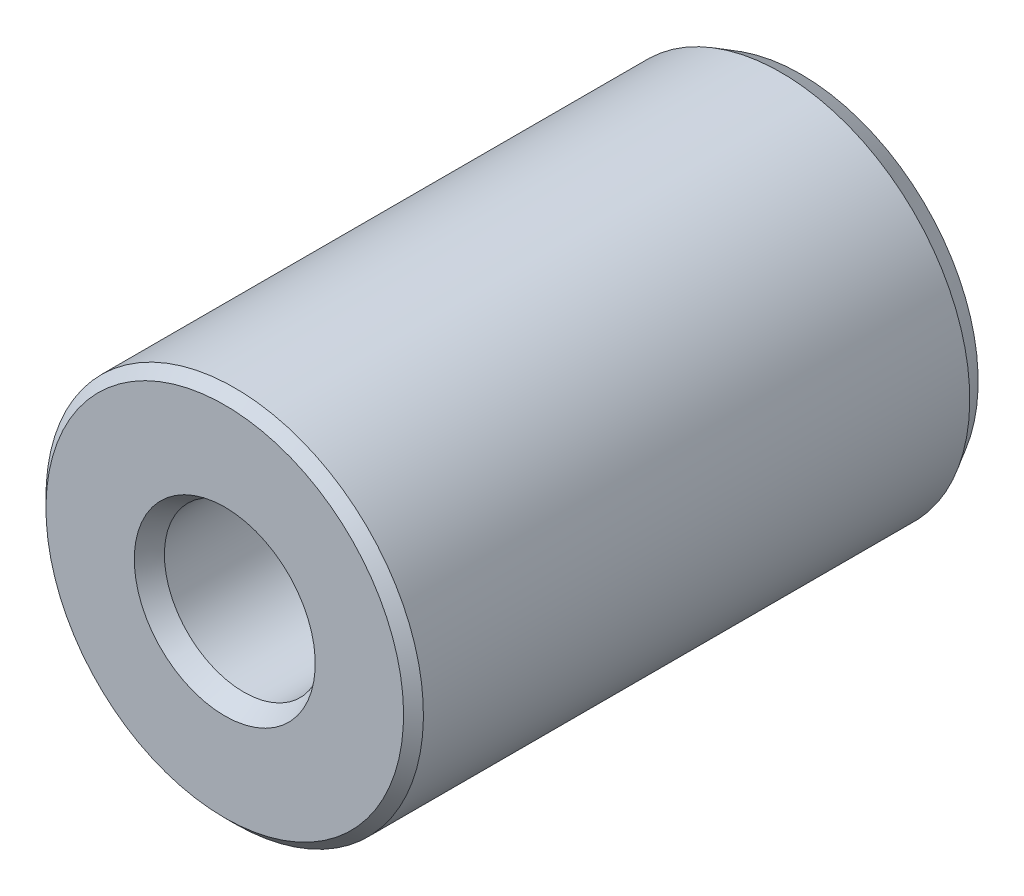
ISO-10303-21;
HEADER;
FILE_DESCRIPTION(('STEP AP214'),'2;1');
FILE_NAME('part.step','',(''),(''),'','','');
FILE_SCHEMA(('AUTOMOTIVE_DESIGN { 1 0 10303 214 1 1 1 1 }'));
ENDSEC;
DATA;
#1=APPLICATION_CONTEXT('core data for automotive mechanical design processes');
#2=APPLICATION_PROTOCOL_DEFINITION('international standard','automotive_design',2000,#1);
#3=PRODUCT_CONTEXT('',#1,'mechanical');
#4=PRODUCT('Part','Part','',(#3));
#5=PRODUCT_RELATED_PRODUCT_CATEGORY('part','',(#4));
#6=PRODUCT_DEFINITION_FORMATION('','',#4);
#7=PRODUCT_DEFINITION_CONTEXT('part definition',#1,'design');
#8=PRODUCT_DEFINITION('design','',#6,#7);
#9=PRODUCT_DEFINITION_SHAPE('','',#8);
#10=(LENGTH_UNIT() NAMED_UNIT(*) SI_UNIT(.MILLI.,.METRE.));
#11=(NAMED_UNIT(*) PLANE_ANGLE_UNIT() SI_UNIT($,.RADIAN.));
#12=(NAMED_UNIT(*) SI_UNIT($,.STERADIAN.) SOLID_ANGLE_UNIT());
#13=UNCERTAINTY_MEASURE_WITH_UNIT(LENGTH_MEASURE(1.E-05),#10,'distance_accuracy_value','');
#14=(GEOMETRIC_REPRESENTATION_CONTEXT(3) GLOBAL_UNCERTAINTY_ASSIGNED_CONTEXT((#13)) GLOBAL_UNIT_ASSIGNED_CONTEXT((#10,
#11,#12)) REPRESENTATION_CONTEXT('',''));
#15=CARTESIAN_POINT('',(0.,0.,0.));
#16=DIRECTION('',(0.,0.,1.));
#17=DIRECTION('',(1.,0.,0.));
#18=AXIS2_PLACEMENT_3D('',#15,#16,#17);
#19=CARTESIAN_POINT('',(0.,0.,30.));
#20=DIRECTION('',(0.,0.,1.));
#21=DIRECTION('',(0.,-1.,0.));
#22=AXIS2_PLACEMENT_3D('',#19,#20,#21);
#23=CYLINDRICAL_SURFACE('',#22,3.4);
#24=CARTESIAN_POINT('',(0.,0.,1.5));
#25=DIRECTION('',(0.,0.,1.));
#26=DIRECTION('',(0.,-1.,0.));
#27=AXIS2_PLACEMENT_3D('',#24,#25,#26);
#28=CIRCLE('',#27,3.4);
#29=CARTESIAN_POINT('',(0.,-3.4,1.5));
#30=VERTEX_POINT('',#29);
#31=EDGE_CURVE('E8',#30,#30,#28,.F.);
#32=ORIENTED_EDGE('',*,*,#31,.T.);
#33=EDGE_LOOP('',(#32));
#34=FACE_BOUND('',#33,.T.);
#35=CARTESIAN_POINT('',(0.,0.,14.));
#36=DIRECTION('',(0.,0.,1.));
#37=DIRECTION('',(1.,0.,0.));
#38=AXIS2_PLACEMENT_3D('',#35,#36,#37);
#39=CIRCLE('',#38,3.4);
#40=CARTESIAN_POINT('',(3.4,0.,14.));
#41=VERTEX_POINT('',#40);
#42=EDGE_CURVE('E16',#41,#41,#39,.F.);
#43=ORIENTED_EDGE('',*,*,#42,.F.);
#44=EDGE_LOOP('',(#43));
#45=FACE_BOUND('',#44,.T.);
#46=ADVANCED_FACE('F12',(#34,#45),#23,.F.);
#47=CARTESIAN_POINT('',(0.,0.,-7.19863890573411));
#48=DIRECTION('',(0.,0.,1.));
#49=DIRECTION('',(0.,-1.,0.));
#50=AXIS2_PLACEMENT_3D('',#47,#48,#49);
#51=CYLINDRICAL_SURFACE('',#50,9.5);
#52=CARTESIAN_POINT('',(0.,0.,2.));
#53=DIRECTION('',(0.,0.,1.));
#54=DIRECTION('',(0.,-1.,0.));
#55=AXIS2_PLACEMENT_3D('',#52,#53,#54);
#56=CIRCLE('',#55,9.5);
#57=CARTESIAN_POINT('',(0.,-9.5,2.));
#58=VERTEX_POINT('',#57);
#59=EDGE_CURVE('E42',#58,#58,#56,.T.);
#60=ORIENTED_EDGE('',*,*,#59,.T.);
#61=EDGE_LOOP('',(#60));
#62=FACE_BOUND('',#61,.T.);
#63=CARTESIAN_POINT('',(0.,0.,29.5));
#64=DIRECTION('',(0.,0.,1.));
#65=DIRECTION('',(0.,-1.,0.));
#66=AXIS2_PLACEMENT_3D('',#63,#64,#65);
#67=CIRCLE('',#66,9.5);
#68=CARTESIAN_POINT('',(0.,-9.5,29.5));
#69=VERTEX_POINT('',#68);
#70=EDGE_CURVE('E34',#69,#69,#67,.T.);
#71=ORIENTED_EDGE('',*,*,#70,.F.);
#72=EDGE_LOOP('',(#71));
#73=FACE_BOUND('',#72,.T.);
#74=ADVANCED_FACE('F82',(#62,#73),#51,.T.);
#75=CARTESIAN_POINT('',(0.,0.,29.5));
#76=DIRECTION('',(0.,0.,-1.));
#77=DIRECTION('',(0.,1.,0.));
#78=AXIS2_PLACEMENT_3D('',#75,#76,#77);
#79=CONICAL_SURFACE('',#78,9.5,0.785398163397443);
#80=CARTESIAN_POINT('',(0.,0.,30.));
#81=DIRECTION('',(0.,0.,1.));
#82=DIRECTION('',(0.,-1.,0.));
#83=AXIS2_PLACEMENT_3D('',#80,#81,#82);
#84=CIRCLE('',#83,9.);
#85=CARTESIAN_POINT('',(0.,-9.,30.));
#86=VERTEX_POINT('',#85);
#87=EDGE_CURVE('E57',#86,#86,#84,.T.);
#88=ORIENTED_EDGE('',*,*,#87,.F.);
#89=EDGE_LOOP('',(#88));
#90=FACE_BOUND('',#89,.T.);
#91=ORIENTED_EDGE('',*,*,#70,.T.);
#92=EDGE_LOOP('',(#91));
#93=FACE_BOUND('',#92,.T.);
#94=ADVANCED_FACE('F88',(#90,#93),#79,.T.);
#95=CARTESIAN_POINT('',(9.,0.,30.));
#96=DIRECTION('',(0.,0.,-1.));
#97=DIRECTION('',(0.,1.,0.));
#98=AXIS2_PLACEMENT_3D('',#95,#96,#97);
#99=PLANE('',#98);
#100=CARTESIAN_POINT('',(0.,0.,30.));
#101=DIRECTION('',(0.,0.,-1.));
#102=DIRECTION('',(0.,1.,0.));
#103=AXIS2_PLACEMENT_3D('',#100,#101,#102);
#104=CIRCLE('',#103,4.55470053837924);
#105=CARTESIAN_POINT('',(0.,4.55470053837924,30.));
#106=VERTEX_POINT('',#105);
#107=EDGE_CURVE('E25',#106,#106,#104,.T.);
#108=ORIENTED_EDGE('',*,*,#107,.T.);
#109=EDGE_LOOP('',(#108));
#110=FACE_BOUND('',#109,.T.);
#111=ORIENTED_EDGE('',*,*,#87,.T.);
#112=EDGE_LOOP('',(#111));
#113=FACE_BOUND('',#112,.T.);
#114=ADVANCED_FACE('F62',(#110,#113),#99,.F.);
#115=CARTESIAN_POINT('',(0.,0.,0.));
#116=DIRECTION('',(0.,0.,1.));
#117=DIRECTION('',(0.,-1.,0.));
#118=AXIS2_PLACEMENT_3D('',#115,#116,#117);
#119=PLANE('',#118);
#120=CARTESIAN_POINT('',(0.,0.,0.));
#121=DIRECTION('',(0.,0.,1.));
#122=DIRECTION('',(0.,-1.,0.));
#123=AXIS2_PLACEMENT_3D('',#120,#121,#122);
#124=CIRCLE('',#123,4.26602540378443);
#125=CARTESIAN_POINT('',(0.,-4.26602540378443,0.));
#126=VERTEX_POINT('',#125);
#127=EDGE_CURVE('E20',#126,#126,#124,.T.);
#128=ORIENTED_EDGE('',*,*,#127,.T.);
#129=EDGE_LOOP('',(#128));
#130=FACE_BOUND('',#129,.T.);
#131=CARTESIAN_POINT('',(0.,0.,0.));
#132=DIRECTION('',(0.,0.,1.));
#133=DIRECTION('',(0.,-1.,0.));
#134=AXIS2_PLACEMENT_3D('',#131,#132,#133);
#135=CIRCLE('',#134,6.5);
#136=CARTESIAN_POINT('',(0.,-6.5,0.));
#137=VERTEX_POINT('',#136);
#138=EDGE_CURVE('E54',#137,#137,#135,.T.);
#139=ORIENTED_EDGE('',*,*,#138,.F.);
#140=EDGE_LOOP('',(#139));
#141=FACE_BOUND('',#140,.T.);
#142=ADVANCED_FACE('F106',(#130,#141),#119,.F.);
#143=CARTESIAN_POINT('',(0.,0.,0.));
#144=DIRECTION('',(0.,0.,1.));
#145=DIRECTION('',(0.,-1.,0.));
#146=AXIS2_PLACEMENT_3D('',#143,#144,#145);
#147=CONICAL_SURFACE('',#146,6.5,0.785398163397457);
#148=CARTESIAN_POINT('',(0.,0.,0.5));
#149=DIRECTION('',(0.,0.,1.));
#150=DIRECTION('',(0.,-1.,0.));
#151=AXIS2_PLACEMENT_3D('',#148,#149,#150);
#152=CIRCLE('',#151,7.);
#153=CARTESIAN_POINT('',(0.,-7.,0.5));
#154=VERTEX_POINT('',#153);
#155=EDGE_CURVE('E51',#154,#154,#152,.T.);
#156=ORIENTED_EDGE('',*,*,#155,.F.);
#157=EDGE_LOOP('',(#156));
#158=FACE_BOUND('',#157,.T.);
#159=ORIENTED_EDGE('',*,*,#138,.T.);
#160=EDGE_LOOP('',(#159));
#161=FACE_BOUND('',#160,.T.);
#162=ADVANCED_FACE('F102',(#158,#161),#147,.T.);
#163=CARTESIAN_POINT('',(0.,0.,-7.19863890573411));
#164=DIRECTION('',(0.,0.,1.));
#165=DIRECTION('',(0.,-1.,0.));
#166=AXIS2_PLACEMENT_3D('',#163,#164,#165);
#167=CYLINDRICAL_SURFACE('',#166,7.);
#168=CARTESIAN_POINT('',(0.,0.,1.));
#169=DIRECTION('',(0.,0.,1.));
#170=DIRECTION('',(0.,-1.,0.));
#171=AXIS2_PLACEMENT_3D('',#168,#169,#170);
#172=CIRCLE('',#171,7.);
#173=CARTESIAN_POINT('',(0.,-7.,1.));
#174=VERTEX_POINT('',#173);
#175=EDGE_CURVE('E48',#174,#174,#172,.T.);
#176=ORIENTED_EDGE('',*,*,#175,.F.);
#177=EDGE_LOOP('',(#176));
#178=FACE_BOUND('',#177,.T.);
#179=ORIENTED_EDGE('',*,*,#155,.T.);
#180=EDGE_LOOP('',(#179));
#181=FACE_BOUND('',#180,.T.);
#182=ADVANCED_FACE('F98',(#178,#181),#167,.T.);
#183=CARTESIAN_POINT('',(7.,0.,1.));
#184=DIRECTION('',(0.,0.,1.));
#185=DIRECTION('',(0.,-1.,0.));
#186=AXIS2_PLACEMENT_3D('',#183,#184,#185);
#187=PLANE('',#186);
#188=CARTESIAN_POINT('',(0.,0.,1.));
#189=DIRECTION('',(0.,0.,1.));
#190=DIRECTION('',(0.,-1.,0.));
#191=AXIS2_PLACEMENT_3D('',#188,#189,#190);
#192=CIRCLE('',#191,8.92264973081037);
#193=CARTESIAN_POINT('',(0.,-8.92264973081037,1.));
#194=VERTEX_POINT('',#193);
#195=EDGE_CURVE('E45',#194,#194,#192,.T.);
#196=ORIENTED_EDGE('',*,*,#195,.F.);
#197=EDGE_LOOP('',(#196));
#198=FACE_BOUND('',#197,.T.);
#199=ORIENTED_EDGE('',*,*,#175,.T.);
#200=EDGE_LOOP('',(#199));
#201=FACE_BOUND('',#200,.T.);
#202=ADVANCED_FACE('F77',(#198,#201),#187,.F.);
#203=CARTESIAN_POINT('',(0.,0.,1.));
#204=DIRECTION('',(0.,0.,1.));
#205=DIRECTION('',(0.,-1.,0.));
#206=AXIS2_PLACEMENT_3D('',#203,#204,#205);
#207=CONICAL_SURFACE('',#206,8.92264973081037,0.523598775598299);
#208=ORIENTED_EDGE('',*,*,#59,.F.);
#209=EDGE_LOOP('',(#208));
#210=FACE_BOUND('',#209,.T.);
#211=ORIENTED_EDGE('',*,*,#195,.T.);
#212=EDGE_LOOP('',(#211));
#213=FACE_BOUND('',#212,.T.);
#214=ADVANCED_FACE('F67',(#210,#213),#207,.T.);
#215=CARTESIAN_POINT('',(0.,0.,28.));
#216=DIRECTION('',(0.,0.,1.));
#217=DIRECTION('',(0.,-1.,0.));
#218=AXIS2_PLACEMENT_3D('',#215,#216,#217);
#219=CONICAL_SURFACE('',#218,3.4,0.523598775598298);
#220=CARTESIAN_POINT('',(0.,0.,29.0392304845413));
#221=DIRECTION('',(0.,0.,1.));
#222=DIRECTION('',(0.,-1.,0.));
#223=AXIS2_PLACEMENT_3D('',#220,#221,#222);
#224=CIRCLE('',#223,4.);
#225=CARTESIAN_POINT('',(0.,-4.,29.0392304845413));
#226=VERTEX_POINT('',#225);
#227=EDGE_CURVE('E28',#226,#226,#224,.T.);
#228=ORIENTED_EDGE('',*,*,#227,.F.);
#229=EDGE_LOOP('',(#228));
#230=FACE_BOUND('',#229,.T.);
#231=ORIENTED_EDGE('',*,*,#107,.F.);
#232=EDGE_LOOP('',(#231));
#233=FACE_BOUND('',#232,.T.);
#234=ADVANCED_FACE('F65',(#230,#233),#219,.F.);
#235=CARTESIAN_POINT('',(0.,0.,0.));
#236=DIRECTION('',(0.,0.,-1.));
#237=DIRECTION('',(0.,1.,0.));
#238=AXIS2_PLACEMENT_3D('',#235,#236,#237);
#239=CONICAL_SURFACE('',#238,4.26602540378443,0.523598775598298);
#240=ORIENTED_EDGE('',*,*,#31,.F.);
#241=EDGE_LOOP('',(#240));
#242=FACE_BOUND('',#241,.T.);
#243=ORIENTED_EDGE('',*,*,#127,.F.);
#244=EDGE_LOOP('',(#243));
#245=FACE_BOUND('',#244,.T.);
#246=ADVANCED_FACE('F14',(#242,#245),#239,.F.);
#247=CARTESIAN_POINT('',(0.,0.,14.));
#248=DIRECTION('',(0.,0.,1.));
#249=DIRECTION('',(1.,0.,0.));
#250=AXIS2_PLACEMENT_3D('',#247,#248,#249);
#251=PLANE('',#250);
#252=CARTESIAN_POINT('',(0.,0.,14.));
#253=DIRECTION('',(0.,0.,1.));
#254=DIRECTION('',(1.,0.,0.));
#255=AXIS2_PLACEMENT_3D('',#252,#253,#254);
#256=CIRCLE('',#255,4.);
#257=CARTESIAN_POINT('',(4.,0.,14.));
#258=VERTEX_POINT('',#257);
#259=EDGE_CURVE('E30',#258,#258,#256,.T.);
#260=ORIENTED_EDGE('',*,*,#259,.T.);
#261=EDGE_LOOP('',(#260));
#262=FACE_BOUND('',#261,.T.);
#263=ORIENTED_EDGE('',*,*,#42,.T.);
#264=EDGE_LOOP('',(#263));
#265=FACE_BOUND('',#264,.T.);
#266=ADVANCED_FACE('F75',(#262,#265),#251,.T.);
#267=CARTESIAN_POINT('',(0.,0.,14.));
#268=DIRECTION('',(0.,0.,1.));
#269=DIRECTION('',(1.,0.,0.));
#270=AXIS2_PLACEMENT_3D('',#267,#268,#269);
#271=CYLINDRICAL_SURFACE('',#270,4.);
#272=ORIENTED_EDGE('',*,*,#227,.T.);
#273=EDGE_LOOP('',(#272));
#274=FACE_BOUND('',#273,.T.);
#275=ORIENTED_EDGE('',*,*,#259,.F.);
#276=EDGE_LOOP('',(#275));
#277=FACE_BOUND('',#276,.T.);
#278=ADVANCED_FACE('F93',(#274,#277),#271,.F.);
#279=CLOSED_SHELL('',(#46,#74,#94,#114,#142,#162,#182,#202,#214,#234,#246,#266,#278));
#280=MANIFOLD_SOLID_BREP('B1',#279);
#281=ADVANCED_BREP_SHAPE_REPRESENTATION('',(#18,#280),#14);
#282=SHAPE_DEFINITION_REPRESENTATION(#9,#281);
ENDSEC;
END-ISO-10303-21;
